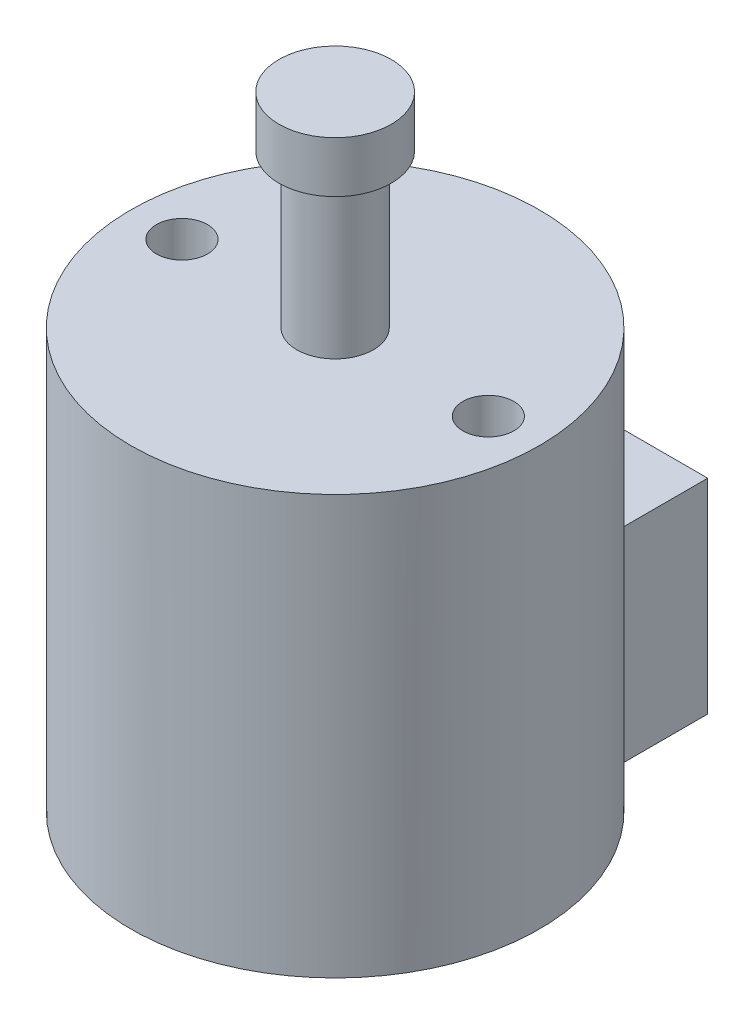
ISO-10303-21;
HEADER;
FILE_DESCRIPTION(('STEP AP214'),'2;1');
FILE_NAME('part.step','',(''),(''),'','','');
FILE_SCHEMA(('AUTOMOTIVE_DESIGN { 1 0 10303 214 1 1 1 1 }'));
ENDSEC;
DATA;
#1=APPLICATION_CONTEXT('core data for automotive mechanical design processes');
#2=APPLICATION_PROTOCOL_DEFINITION('international standard','automotive_design',2000,#1);
#3=PRODUCT_CONTEXT('',#1,'mechanical');
#4=PRODUCT('Part','Part','',(#3));
#5=PRODUCT_RELATED_PRODUCT_CATEGORY('part','',(#4));
#6=PRODUCT_DEFINITION_FORMATION('','',#4);
#7=PRODUCT_DEFINITION_CONTEXT('part definition',#1,'design');
#8=PRODUCT_DEFINITION('design','',#6,#7);
#9=PRODUCT_DEFINITION_SHAPE('','',#8);
#10=(LENGTH_UNIT() NAMED_UNIT(*) SI_UNIT(.MILLI.,.METRE.));
#11=(NAMED_UNIT(*) PLANE_ANGLE_UNIT() SI_UNIT($,.RADIAN.));
#12=(NAMED_UNIT(*) SI_UNIT($,.STERADIAN.) SOLID_ANGLE_UNIT());
#13=UNCERTAINTY_MEASURE_WITH_UNIT(LENGTH_MEASURE(1.E-05),#10,'distance_accuracy_value','');
#14=(GEOMETRIC_REPRESENTATION_CONTEXT(3) GLOBAL_UNCERTAINTY_ASSIGNED_CONTEXT((#13)) GLOBAL_UNIT_ASSIGNED_CONTEXT((#10,
#11,#12)) REPRESENTATION_CONTEXT('',''));
#15=CARTESIAN_POINT('',(0.,0.,0.));
#16=DIRECTION('',(0.,0.,1.));
#17=DIRECTION('',(1.,0.,0.));
#18=AXIS2_PLACEMENT_3D('',#15,#16,#17);
#19=CARTESIAN_POINT('',(0.,12.2,0.));
#20=DIRECTION('',(0.,-1.,0.));
#21=DIRECTION('',(0.,0.,-1.));
#22=AXIS2_PLACEMENT_3D('',#19,#20,#21);
#23=CYLINDRICAL_SURFACE('',#22,0.75);
#24=CARTESIAN_POINT('',(0.,8.2,0.));
#25=DIRECTION('',(0.,1.,0.));
#26=DIRECTION('',(0.,0.,1.));
#27=AXIS2_PLACEMENT_3D('',#24,#25,#26);
#28=CIRCLE('',#27,0.75);
#29=CARTESIAN_POINT('',(0.,8.2,0.75));
#30=VERTEX_POINT('',#29);
#31=EDGE_CURVE('E47',#30,#30,#28,.T.);
#32=ORIENTED_EDGE('',*,*,#31,.T.);
#33=EDGE_LOOP('',(#32));
#34=FACE_BOUND('',#33,.T.);
#35=CARTESIAN_POINT('',(0.,11.2,0.));
#36=DIRECTION('',(0.,1.,0.));
#37=DIRECTION('',(0.,0.,1.));
#38=AXIS2_PLACEMENT_3D('',#35,#36,#37);
#39=CIRCLE('',#38,0.75);
#40=CARTESIAN_POINT('',(0.,11.2,0.75));
#41=VERTEX_POINT('',#40);
#42=EDGE_CURVE('E11',#41,#41,#39,.T.);
#43=ORIENTED_EDGE('',*,*,#42,.F.);
#44=EDGE_LOOP('',(#43));
#45=FACE_BOUND('',#44,.T.);
#46=ADVANCED_FACE('F38',(#34,#45),#23,.T.);
#47=CARTESIAN_POINT('',(-2.,4.,-5.2963798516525));
#48=DIRECTION('',(0.,0.,1.));
#49=DIRECTION('',(1.,0.,0.));
#50=AXIS2_PLACEMENT_3D('',#47,#48,#49);
#51=PLANE('',#50);
#52=DIRECTION('',(1.,0.,0.));
#53=VECTOR('',#52,1.);
#54=CARTESIAN_POINT('',(0.840952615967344,2.16818239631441,-5.2963798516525));
#55=LINE('',#54,#53);
#56=CARTESIAN_POINT('',(0.175,2.16818239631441,-5.2963798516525));
#57=VERTEX_POINT('',#56);
#58=CARTESIAN_POINT('',(0.840952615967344,2.16818239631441,-5.2963798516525));
#59=VERTEX_POINT('',#58);
#60=EDGE_CURVE('E266',#57,#59,#55,.T.);
#61=ORIENTED_EDGE('',*,*,#60,.F.);
#62=DIRECTION('',(0.,1.,0.));
#63=VECTOR('',#62,1.);
#64=CARTESIAN_POINT('',(0.175,2.16818239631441,-5.2963798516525));
#65=LINE('',#64,#63);
#66=CARTESIAN_POINT('',(0.175,1.50222978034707,-5.2963798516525));
#67=VERTEX_POINT('',#66);
#68=EDGE_CURVE('E278',#67,#57,#65,.T.);
#69=ORIENTED_EDGE('',*,*,#68,.F.);
#70=DIRECTION('',(-1.,0.,0.));
#71=VECTOR('',#70,1.);
#72=CARTESIAN_POINT('',(0.840952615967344,1.50222978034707,-5.2963798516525));
#73=LINE('',#72,#71);
#74=CARTESIAN_POINT('',(0.840952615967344,1.50222978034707,-5.2963798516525));
#75=VERTEX_POINT('',#74);
#76=EDGE_CURVE('E274',#75,#67,#73,.T.);
#77=ORIENTED_EDGE('',*,*,#76,.F.);
#78=DIRECTION('',(0.,-1.,0.));
#79=VECTOR('',#78,1.);
#80=CARTESIAN_POINT('',(0.840952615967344,2.16818239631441,-5.2963798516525));
#81=LINE('',#80,#79);
#82=EDGE_CURVE('E270',#59,#75,#81,.T.);
#83=ORIENTED_EDGE('',*,*,#82,.F.);
#84=EDGE_LOOP('',(#61,#69,#77,#83));
#85=FACE_BOUND('',#84,.T.);
#86=DIRECTION('',(0.,1.,0.));
#87=VECTOR('',#86,1.);
#88=CARTESIAN_POINT('',(-1.85690523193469,2.16818239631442,-5.2963798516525));
#89=LINE('',#88,#87);
#90=CARTESIAN_POINT('',(-1.85690523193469,1.50222978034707,-5.2963798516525));
#91=VERTEX_POINT('',#90);
#92=CARTESIAN_POINT('',(-1.85690523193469,2.16818239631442,-5.2963798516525));
#93=VERTEX_POINT('',#92);
#94=EDGE_CURVE('E322',#91,#93,#89,.T.);
#95=ORIENTED_EDGE('',*,*,#94,.F.);
#96=DIRECTION('',(-1.,0.,0.));
#97=VECTOR('',#96,1.);
#98=CARTESIAN_POINT('',(-1.85690523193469,1.50222978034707,-5.2963798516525));
#99=LINE('',#98,#97);
#100=CARTESIAN_POINT('',(-1.19095261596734,1.50222978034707,-5.2963798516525));
#101=VERTEX_POINT('',#100);
#102=EDGE_CURVE('E334',#101,#91,#99,.T.);
#103=ORIENTED_EDGE('',*,*,#102,.F.);
#104=DIRECTION('',(0.,-1.,0.));
#105=VECTOR('',#104,1.);
#106=CARTESIAN_POINT('',(-1.19095261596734,2.16818239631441,-5.2963798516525));
#107=LINE('',#106,#105);
#108=CARTESIAN_POINT('',(-1.19095261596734,2.16818239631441,-5.2963798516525));
#109=VERTEX_POINT('',#108);
#110=EDGE_CURVE('E330',#109,#101,#107,.T.);
#111=ORIENTED_EDGE('',*,*,#110,.F.);
#112=DIRECTION('',(1.,0.,0.));
#113=VECTOR('',#112,1.);
#114=CARTESIAN_POINT('',(-1.85690523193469,2.16818239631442,-5.2963798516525));
#115=LINE('',#114,#113);
#116=EDGE_CURVE('E326',#93,#109,#115,.T.);
#117=ORIENTED_EDGE('',*,*,#116,.F.);
#118=EDGE_LOOP('',(#95,#103,#111,#117));
#119=FACE_BOUND('',#118,.T.);
#120=DIRECTION('',(-1.,0.,0.));
#121=VECTOR('',#120,1.);
#122=CARTESIAN_POINT('',(-2.,0.,-5.2963798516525));
#123=LINE('',#122,#121);
#124=CARTESIAN_POINT('',(2.,0.,-5.2963798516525));
#125=VERTEX_POINT('',#124);
#126=CARTESIAN_POINT('',(-2.,0.,-5.2963798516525));
#127=VERTEX_POINT('',#126);
#128=EDGE_CURVE('E356',#125,#127,#123,.T.);
#129=ORIENTED_EDGE('',*,*,#128,.T.);
#130=DIRECTION('',(0.,-1.,0.));
#131=VECTOR('',#130,1.);
#132=CARTESIAN_POINT('',(-2.,4.,-5.2963798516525));
#133=LINE('',#132,#131);
#134=CARTESIAN_POINT('',(-2.,4.,-5.2963798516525));
#135=VERTEX_POINT('',#134);
#136=EDGE_CURVE('E362',#135,#127,#133,.T.);
#137=ORIENTED_EDGE('',*,*,#136,.F.);
#138=DIRECTION('',(-1.,0.,0.));
#139=VECTOR('',#138,1.);
#140=CARTESIAN_POINT('',(-2.,4.,-5.2963798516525));
#141=LINE('',#140,#139);
#142=CARTESIAN_POINT('',(2.,4.,-5.2963798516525));
#143=VERTEX_POINT('',#142);
#144=EDGE_CURVE('E359',#143,#135,#141,.T.);
#145=ORIENTED_EDGE('',*,*,#144,.F.);
#146=DIRECTION('',(0.,-1.,0.));
#147=VECTOR('',#146,1.);
#148=CARTESIAN_POINT('',(2.,4.,-5.2963798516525));
#149=LINE('',#148,#147);
#150=EDGE_CURVE('E374',#143,#125,#149,.T.);
#151=ORIENTED_EDGE('',*,*,#150,.T.);
#152=EDGE_LOOP('',(#129,#137,#145,#151));
#153=FACE_BOUND('',#152,.T.);
#154=DIRECTION('',(0.,1.,0.));
#155=VECTOR('',#154,1.);
#156=CARTESIAN_POINT('',(-0.840952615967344,2.16818239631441,-5.2963798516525));
#157=LINE('',#156,#155);
#158=CARTESIAN_POINT('',(-0.840952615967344,1.50222978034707,-5.2963798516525));
#159=VERTEX_POINT('',#158);
#160=CARTESIAN_POINT('',(-0.840952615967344,2.16818239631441,-5.2963798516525));
#161=VERTEX_POINT('',#160);
#162=EDGE_CURVE('E294',#159,#161,#157,.T.);
#163=ORIENTED_EDGE('',*,*,#162,.F.);
#164=DIRECTION('',(-1.,0.,0.));
#165=VECTOR('',#164,1.);
#166=CARTESIAN_POINT('',(-0.840952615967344,1.50222978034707,-5.2963798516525));
#167=LINE('',#166,#165);
#168=CARTESIAN_POINT('',(-0.175,1.50222978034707,-5.2963798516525));
#169=VERTEX_POINT('',#168);
#170=EDGE_CURVE('E306',#169,#159,#167,.T.);
#171=ORIENTED_EDGE('',*,*,#170,.F.);
#172=DIRECTION('',(0.,-1.,0.));
#173=VECTOR('',#172,1.);
#174=CARTESIAN_POINT('',(-0.175,2.16818239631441,-5.2963798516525));
#175=LINE('',#174,#173);
#176=CARTESIAN_POINT('',(-0.175,2.16818239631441,-5.2963798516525));
#177=VERTEX_POINT('',#176);
#178=EDGE_CURVE('E302',#177,#169,#175,.T.);
#179=ORIENTED_EDGE('',*,*,#178,.F.);
#180=DIRECTION('',(1.,0.,0.));
#181=VECTOR('',#180,1.);
#182=CARTESIAN_POINT('',(-0.840952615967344,2.16818239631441,-5.2963798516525));
#183=LINE('',#182,#181);
#184=EDGE_CURVE('E298',#161,#177,#183,.T.);
#185=ORIENTED_EDGE('',*,*,#184,.F.);
#186=EDGE_LOOP('',(#163,#171,#179,#185));
#187=FACE_BOUND('',#186,.T.);
#188=DIRECTION('',(1.,0.,0.));
#189=VECTOR('',#188,1.);
#190=CARTESIAN_POINT('',(1.85690523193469,2.16818239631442,-5.2963798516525));
#191=LINE('',#190,#189);
#192=CARTESIAN_POINT('',(1.19095261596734,2.16818239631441,-5.2963798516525));
#193=VERTEX_POINT('',#192);
#194=CARTESIAN_POINT('',(1.85690523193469,2.16818239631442,-5.2963798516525));
#195=VERTEX_POINT('',#194);
#196=EDGE_CURVE('E228',#193,#195,#191,.T.);
#197=ORIENTED_EDGE('',*,*,#196,.F.);
#198=DIRECTION('',(0.,1.,0.));
#199=VECTOR('',#198,1.);
#200=CARTESIAN_POINT('',(1.19095261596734,2.16818239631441,-5.2963798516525));
#201=LINE('',#200,#199);
#202=CARTESIAN_POINT('',(1.19095261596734,1.50222978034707,-5.2963798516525));
#203=VERTEX_POINT('',#202);
#204=EDGE_CURVE('E237',#203,#193,#201,.T.);
#205=ORIENTED_EDGE('',*,*,#204,.F.);
#206=DIRECTION('',(-1.,0.,0.));
#207=VECTOR('',#206,1.);
#208=CARTESIAN_POINT('',(1.85690523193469,1.50222978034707,-5.2963798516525));
#209=LINE('',#208,#207);
#210=CARTESIAN_POINT('',(1.85690523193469,1.50222978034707,-5.2963798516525));
#211=VERTEX_POINT('',#210);
#212=EDGE_CURVE('E252',#211,#203,#209,.T.);
#213=ORIENTED_EDGE('',*,*,#212,.F.);
#214=DIRECTION('',(0.,-1.,0.));
#215=VECTOR('',#214,1.);
#216=CARTESIAN_POINT('',(1.85690523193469,2.16818239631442,-5.2963798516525));
#217=LINE('',#216,#215);
#218=EDGE_CURVE('E246',#195,#211,#217,.T.);
#219=ORIENTED_EDGE('',*,*,#218,.F.);
#220=EDGE_LOOP('',(#197,#205,#213,#219));
#221=FACE_BOUND('',#220,.T.);
#222=ADVANCED_FACE('F242',(#85,#119,#153,#187,#221),#51,.F.);
#223=CARTESIAN_POINT('',(0.,8.2,0.));
#224=DIRECTION('',(0.,-1.,0.));
#225=DIRECTION('',(0.,0.,-1.));
#226=AXIS2_PLACEMENT_3D('',#223,#224,#225);
#227=CYLINDRICAL_SURFACE('',#226,4.);
#228=CARTESIAN_POINT('',(0.,8.2,0.));
#229=DIRECTION('',(0.,1.,0.));
#230=DIRECTION('',(0.,0.,1.));
#231=AXIS2_PLACEMENT_3D('',#228,#229,#230);
#232=CIRCLE('',#231,4.);
#233=CARTESIAN_POINT('',(0.,8.2,4.));
#234=VERTEX_POINT('',#233);
#235=EDGE_CURVE('E387',#234,#234,#232,.T.);
#236=ORIENTED_EDGE('',*,*,#235,.F.);
#237=EDGE_LOOP('',(#236));
#238=FACE_BOUND('',#237,.T.);
#239=DIRECTION('',(0.,-1.,0.));
#240=VECTOR('',#239,1.);
#241=CARTESIAN_POINT('',(-2.,8.2,-3.46410161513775));
#242=LINE('',#241,#240);
#243=CARTESIAN_POINT('',(-2.,0.,-3.46410161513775));
#244=VERTEX_POINT('',#243);
#245=CARTESIAN_POINT('',(-2.,4.,-3.46410161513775));
#246=VERTEX_POINT('',#245);
#247=EDGE_CURVE('E382',#244,#246,#242,.F.);
#248=ORIENTED_EDGE('',*,*,#247,.F.);
#249=CARTESIAN_POINT('',(0.,0.,0.));
#250=DIRECTION('',(0.,1.,0.));
#251=DIRECTION('',(0.,0.,1.));
#252=AXIS2_PLACEMENT_3D('',#249,#250,#251);
#253=CIRCLE('',#252,4.);
#254=CARTESIAN_POINT('',(2.,0.,-3.46410161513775));
#255=VERTEX_POINT('',#254);
#256=EDGE_CURVE('E386',#244,#255,#253,.T.);
#257=ORIENTED_EDGE('',*,*,#256,.T.);
#258=DIRECTION('',(0.,-1.,0.));
#259=VECTOR('',#258,1.);
#260=CARTESIAN_POINT('',(2.,8.2,-3.46410161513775));
#261=LINE('',#260,#259);
#262=CARTESIAN_POINT('',(2.,4.,-3.46410161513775));
#263=VERTEX_POINT('',#262);
#264=EDGE_CURVE('E378',#263,#255,#261,.T.);
#265=ORIENTED_EDGE('',*,*,#264,.F.);
#266=CARTESIAN_POINT('',(0.,4.,0.));
#267=DIRECTION('',(0.,1.,0.));
#268=DIRECTION('',(0.,0.,1.));
#269=AXIS2_PLACEMENT_3D('',#266,#267,#268);
#270=CIRCLE('',#269,4.);
#271=EDGE_CURVE('E391',#263,#246,#270,.T.);
#272=ORIENTED_EDGE('',*,*,#271,.T.);
#273=EDGE_LOOP('',(#248,#257,#265,#272));
#274=FACE_BOUND('',#273,.T.);
#275=ADVANCED_FACE('F609',(#238,#274),#227,.T.);
#276=CARTESIAN_POINT('',(0.,8.2,0.));
#277=DIRECTION('',(0.,1.,0.));
#278=DIRECTION('',(0.,0.,1.));
#279=AXIS2_PLACEMENT_3D('',#276,#277,#278);
#280=PLANE('',#279);
#281=CARTESIAN_POINT('',(3.,8.2,0.));
#282=DIRECTION('',(0.,1.,0.));
#283=DIRECTION('',(0.,0.,1.));
#284=AXIS2_PLACEMENT_3D('',#281,#282,#283);
#285=CIRCLE('',#284,0.5);
#286=CARTESIAN_POINT('',(3.,8.2,0.5));
#287=VERTEX_POINT('',#286);
#288=EDGE_CURVE('E588',#287,#287,#285,.T.);
#289=ORIENTED_EDGE('',*,*,#288,.F.);
#290=EDGE_LOOP('',(#289));
#291=FACE_BOUND('',#290,.T.);
#292=CARTESIAN_POINT('',(-3.,8.2,0.));
#293=DIRECTION('',(0.,1.,0.));
#294=DIRECTION('',(0.,0.,1.));
#295=AXIS2_PLACEMENT_3D('',#292,#293,#294);
#296=CIRCLE('',#295,0.5);
#297=CARTESIAN_POINT('',(-3.,8.2,0.5));
#298=VERTEX_POINT('',#297);
#299=EDGE_CURVE('E584',#298,#298,#296,.T.);
#300=ORIENTED_EDGE('',*,*,#299,.F.);
#301=EDGE_LOOP('',(#300));
#302=FACE_BOUND('',#301,.T.);
#303=ORIENTED_EDGE('',*,*,#31,.F.);
#304=EDGE_LOOP('',(#303));
#305=FACE_BOUND('',#304,.T.);
#306=ORIENTED_EDGE('',*,*,#235,.T.);
#307=EDGE_LOOP('',(#306));
#308=FACE_BOUND('',#307,.T.);
#309=ADVANCED_FACE('F605',(#291,#302,#305,#308),#280,.T.);
#310=CARTESIAN_POINT('',(0.,0.,0.));
#311=DIRECTION('',(0.,1.,0.));
#312=DIRECTION('',(0.,0.,1.));
#313=AXIS2_PLACEMENT_3D('',#310,#311,#312);
#314=PLANE('',#313);
#315=ORIENTED_EDGE('',*,*,#256,.F.);
#316=DIRECTION('',(0.,0.,1.));
#317=VECTOR('',#316,1.);
#318=CARTESIAN_POINT('',(-2.,0.,-5.2963798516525));
#319=LINE('',#318,#317);
#320=EDGE_CURVE('E350',#127,#244,#319,.T.);
#321=ORIENTED_EDGE('',*,*,#320,.F.);
#322=ORIENTED_EDGE('',*,*,#128,.F.);
#323=DIRECTION('',(0.,0.,-1.));
#324=VECTOR('',#323,1.);
#325=CARTESIAN_POINT('',(2.,0.,-5.2963798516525));
#326=LINE('',#325,#324);
#327=EDGE_CURVE('E366',#255,#125,#326,.T.);
#328=ORIENTED_EDGE('',*,*,#327,.F.);
#329=EDGE_LOOP('',(#315,#321,#322,#328));
#330=FACE_BOUND('',#329,.T.);
#331=ADVANCED_FACE('F608',(#330),#314,.F.);
#332=CARTESIAN_POINT('',(-2.,4.,-5.2963798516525));
#333=DIRECTION('',(1.,0.,0.));
#334=DIRECTION('',(0.,0.,-1.));
#335=AXIS2_PLACEMENT_3D('',#332,#333,#334);
#336=PLANE('',#335);
#337=ORIENTED_EDGE('',*,*,#320,.T.);
#338=ORIENTED_EDGE('',*,*,#247,.T.);
#339=DIRECTION('',(0.,0.,1.));
#340=VECTOR('',#339,1.);
#341=CARTESIAN_POINT('',(-2.,4.,-5.2963798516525));
#342=LINE('',#341,#340);
#343=EDGE_CURVE('E351',#135,#246,#342,.T.);
#344=ORIENTED_EDGE('',*,*,#343,.F.);
#345=ORIENTED_EDGE('',*,*,#136,.T.);
#346=EDGE_LOOP('',(#337,#338,#344,#345));
#347=FACE_BOUND('',#346,.T.);
#348=ADVANCED_FACE('F625',(#347),#336,.F.);
#349=CARTESIAN_POINT('',(2.,4.,-5.2963798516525));
#350=DIRECTION('',(-1.,0.,0.));
#351=DIRECTION('',(0.,0.,1.));
#352=AXIS2_PLACEMENT_3D('',#349,#350,#351);
#353=PLANE('',#352);
#354=DIRECTION('',(0.,0.,-1.));
#355=VECTOR('',#354,1.);
#356=CARTESIAN_POINT('',(2.,4.,-5.2963798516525));
#357=LINE('',#356,#355);
#358=EDGE_CURVE('E355',#263,#143,#357,.T.);
#359=ORIENTED_EDGE('',*,*,#358,.F.);
#360=ORIENTED_EDGE('',*,*,#264,.T.);
#361=ORIENTED_EDGE('',*,*,#327,.T.);
#362=ORIENTED_EDGE('',*,*,#150,.F.);
#363=EDGE_LOOP('',(#359,#360,#361,#362));
#364=FACE_BOUND('',#363,.T.);
#365=ADVANCED_FACE('F633',(#364),#353,.F.);
#366=CARTESIAN_POINT('',(0.,4.,0.));
#367=DIRECTION('',(0.,1.,0.));
#368=DIRECTION('',(0.,0.,1.));
#369=AXIS2_PLACEMENT_3D('',#366,#367,#368);
#370=PLANE('',#369);
#371=ORIENTED_EDGE('',*,*,#271,.F.);
#372=ORIENTED_EDGE('',*,*,#358,.T.);
#373=ORIENTED_EDGE('',*,*,#144,.T.);
#374=ORIENTED_EDGE('',*,*,#343,.T.);
#375=EDGE_LOOP('',(#371,#372,#373,#374));
#376=FACE_BOUND('',#375,.T.);
#377=ADVANCED_FACE('F638',(#376),#370,.T.);
#378=CARTESIAN_POINT('',(-1.85690523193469,2.16818239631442,-5.5503798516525));
#379=DIRECTION('',(1.,0.,0.));
#380=DIRECTION('',(0.,0.,-1.));
#381=AXIS2_PLACEMENT_3D('',#378,#379,#380);
#382=PLANE('',#381);
#383=DIRECTION('',(0.,0.,1.));
#384=VECTOR('',#383,1.);
#385=CARTESIAN_POINT('',(-1.85690523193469,2.16818239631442,-5.5503798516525));
#386=LINE('',#385,#384);
#387=CARTESIAN_POINT('',(-1.85690523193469,2.16818239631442,-5.3503798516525));
#388=VERTEX_POINT('',#387);
#389=EDGE_CURVE('E347',#388,#93,#386,.T.);
#390=ORIENTED_EDGE('',*,*,#389,.F.);
#391=DIRECTION('',(0.,1.,0.));
#392=VECTOR('',#391,1.);
#393=CARTESIAN_POINT('',(-1.85690523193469,2.16818239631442,-5.3503798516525));
#394=LINE('',#393,#392);
#395=CARTESIAN_POINT('',(-1.85690523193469,1.50222978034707,-5.3503798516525));
#396=VERTEX_POINT('',#395);
#397=EDGE_CURVE('E419',#388,#396,#394,.F.);
#398=ORIENTED_EDGE('',*,*,#397,.T.);
#399=DIRECTION('',(0.,0.,1.));
#400=VECTOR('',#399,1.);
#401=CARTESIAN_POINT('',(-1.85690523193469,1.50222978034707,-5.5503798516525));
#402=LINE('',#401,#400);
#403=EDGE_CURVE('E338',#396,#91,#402,.T.);
#404=ORIENTED_EDGE('',*,*,#403,.T.);
#405=ORIENTED_EDGE('',*,*,#94,.T.);
#406=EDGE_LOOP('',(#390,#398,#404,#405));
#407=FACE_BOUND('',#406,.T.);
#408=ADVANCED_FACE('F640',(#407),#382,.F.);
#409=CARTESIAN_POINT('',(-1.85690523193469,2.16818239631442,-5.5503798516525));
#410=DIRECTION('',(0.,-1.,0.));
#411=DIRECTION('',(1.,0.,0.));
#412=AXIS2_PLACEMENT_3D('',#409,#410,#411);
#413=PLANE('',#412);
#414=DIRECTION('',(0.,0.,1.));
#415=VECTOR('',#414,1.);
#416=CARTESIAN_POINT('',(-1.19095261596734,2.16818239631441,-5.5503798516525));
#417=LINE('',#416,#415);
#418=CARTESIAN_POINT('',(-1.19095261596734,2.16818239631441,-5.3503798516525));
#419=VERTEX_POINT('',#418);
#420=EDGE_CURVE('E344',#419,#109,#417,.T.);
#421=ORIENTED_EDGE('',*,*,#420,.F.);
#422=DIRECTION('',(1.,0.,0.));
#423=VECTOR('',#422,1.);
#424=CARTESIAN_POINT('',(-1.85690523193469,2.16818239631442,-5.3503798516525));
#425=LINE('',#424,#423);
#426=EDGE_CURVE('E416',#419,#388,#425,.F.);
#427=ORIENTED_EDGE('',*,*,#426,.T.);
#428=ORIENTED_EDGE('',*,*,#389,.T.);
#429=ORIENTED_EDGE('',*,*,#116,.T.);
#430=EDGE_LOOP('',(#421,#427,#428,#429));
#431=FACE_BOUND('',#430,.T.);
#432=ADVANCED_FACE('F646',(#431),#413,.F.);
#433=CARTESIAN_POINT('',(-1.19095261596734,2.16818239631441,-5.5503798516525));
#434=DIRECTION('',(-1.,0.,0.));
#435=DIRECTION('',(0.,0.,1.));
#436=AXIS2_PLACEMENT_3D('',#433,#434,#435);
#437=PLANE('',#436);
#438=DIRECTION('',(0.,0.,1.));
#439=VECTOR('',#438,1.);
#440=CARTESIAN_POINT('',(-1.19095261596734,1.50222978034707,-5.5503798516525));
#441=LINE('',#440,#439);
#442=CARTESIAN_POINT('',(-1.19095261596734,1.50222978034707,-5.3503798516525));
#443=VERTEX_POINT('',#442);
#444=EDGE_CURVE('E341',#443,#101,#441,.T.);
#445=ORIENTED_EDGE('',*,*,#444,.F.);
#446=DIRECTION('',(0.,-1.,0.));
#447=VECTOR('',#446,1.);
#448=CARTESIAN_POINT('',(-1.19095261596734,2.16818239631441,-5.3503798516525));
#449=LINE('',#448,#447);
#450=EDGE_CURVE('E413',#443,#419,#449,.F.);
#451=ORIENTED_EDGE('',*,*,#450,.T.);
#452=ORIENTED_EDGE('',*,*,#420,.T.);
#453=ORIENTED_EDGE('',*,*,#110,.T.);
#454=EDGE_LOOP('',(#445,#451,#452,#453));
#455=FACE_BOUND('',#454,.T.);
#456=ADVANCED_FACE('F723',(#455),#437,.F.);
#457=CARTESIAN_POINT('',(-1.85690523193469,1.50222978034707,-5.5503798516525));
#458=DIRECTION('',(0.,1.,0.));
#459=DIRECTION('',(0.,0.,1.));
#460=AXIS2_PLACEMENT_3D('',#457,#458,#459);
#461=PLANE('',#460);
#462=ORIENTED_EDGE('',*,*,#403,.F.);
#463=DIRECTION('',(-1.,0.,0.));
#464=VECTOR('',#463,1.);
#465=CARTESIAN_POINT('',(-1.85690523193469,1.50222978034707,-5.3503798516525));
#466=LINE('',#465,#464);
#467=EDGE_CURVE('E409',#396,#443,#466,.F.);
#468=ORIENTED_EDGE('',*,*,#467,.T.);
#469=ORIENTED_EDGE('',*,*,#444,.T.);
#470=ORIENTED_EDGE('',*,*,#102,.T.);
#471=EDGE_LOOP('',(#462,#468,#469,#470));
#472=FACE_BOUND('',#471,.T.);
#473=ADVANCED_FACE('F719',(#472),#461,.F.);
#474=CARTESIAN_POINT('',(0.,0.,-5.5503798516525));
#475=DIRECTION('',(0.,0.,1.));
#476=DIRECTION('',(1.,0.,0.));
#477=AXIS2_PLACEMENT_3D('',#474,#475,#476);
#478=PLANE('',#477);
#479=DIRECTION('',(0.,-1.,0.));
#480=VECTOR('',#479,1.);
#481=CARTESIAN_POINT('',(-1.39095261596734,0.,-5.5503798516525));
#482=LINE('',#481,#480);
#483=CARTESIAN_POINT('',(-1.39095261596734,1.96818239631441,-5.5503798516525));
#484=VERTEX_POINT('',#483);
#485=CARTESIAN_POINT('',(-1.39095261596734,1.70222978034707,-5.5503798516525));
#486=VERTEX_POINT('',#485);
#487=EDGE_CURVE('E402',#484,#486,#482,.T.);
#488=ORIENTED_EDGE('',*,*,#487,.T.);
#489=DIRECTION('',(-1.,0.,0.));
#490=VECTOR('',#489,1.);
#491=CARTESIAN_POINT('',(0.,1.70222978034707,-5.5503798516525));
#492=LINE('',#491,#490);
#493=CARTESIAN_POINT('',(-1.65690523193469,1.70222978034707,-5.5503798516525));
#494=VERTEX_POINT('',#493);
#495=EDGE_CURVE('E405',#486,#494,#492,.T.);
#496=ORIENTED_EDGE('',*,*,#495,.T.);
#497=DIRECTION('',(0.,1.,0.));
#498=VECTOR('',#497,1.);
#499=CARTESIAN_POINT('',(-1.65690523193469,0.,-5.5503798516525));
#500=LINE('',#499,#498);
#501=CARTESIAN_POINT('',(-1.65690523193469,1.96818239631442,-5.5503798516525));
#502=VERTEX_POINT('',#501);
#503=EDGE_CURVE('E396',#494,#502,#500,.T.);
#504=ORIENTED_EDGE('',*,*,#503,.T.);
#505=DIRECTION('',(1.,0.,0.));
#506=VECTOR('',#505,1.);
#507=CARTESIAN_POINT('',(0.,1.96818239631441,-5.5503798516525));
#508=LINE('',#507,#506);
#509=EDGE_CURVE('E399',#502,#484,#508,.T.);
#510=ORIENTED_EDGE('',*,*,#509,.T.);
#511=EDGE_LOOP('',(#488,#496,#504,#510));
#512=FACE_BOUND('',#511,.T.);
#513=ADVANCED_FACE('F715',(#512),#478,.F.);
#514=CARTESIAN_POINT('',(-0.840952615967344,2.16818239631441,-5.5503798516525));
#515=DIRECTION('',(1.,0.,0.));
#516=DIRECTION('',(0.,0.,-1.));
#517=AXIS2_PLACEMENT_3D('',#514,#515,#516);
#518=PLANE('',#517);
#519=DIRECTION('',(0.,0.,1.));
#520=VECTOR('',#519,1.);
#521=CARTESIAN_POINT('',(-0.840952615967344,2.16818239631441,-5.5503798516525));
#522=LINE('',#521,#520);
#523=CARTESIAN_POINT('',(-0.840952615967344,2.16818239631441,-5.3503798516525));
#524=VERTEX_POINT('',#523);
#525=EDGE_CURVE('E319',#524,#161,#522,.T.);
#526=ORIENTED_EDGE('',*,*,#525,.F.);
#527=DIRECTION('',(0.,1.,0.));
#528=VECTOR('',#527,1.);
#529=CARTESIAN_POINT('',(-0.840952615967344,2.16818239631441,-5.3503798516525));
#530=LINE('',#529,#528);
#531=CARTESIAN_POINT('',(-0.840952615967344,1.50222978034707,-5.3503798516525));
#532=VERTEX_POINT('',#531);
#533=EDGE_CURVE('E445',#524,#532,#530,.F.);
#534=ORIENTED_EDGE('',*,*,#533,.T.);
#535=DIRECTION('',(0.,0.,1.));
#536=VECTOR('',#535,1.);
#537=CARTESIAN_POINT('',(-0.840952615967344,1.50222978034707,-5.5503798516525));
#538=LINE('',#537,#536);
#539=EDGE_CURVE('E310',#532,#159,#538,.T.);
#540=ORIENTED_EDGE('',*,*,#539,.T.);
#541=ORIENTED_EDGE('',*,*,#162,.T.);
#542=EDGE_LOOP('',(#526,#534,#540,#541));
#543=FACE_BOUND('',#542,.T.);
#544=ADVANCED_FACE('F711',(#543),#518,.F.);
#545=CARTESIAN_POINT('',(-0.840952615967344,2.16818239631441,-5.5503798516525));
#546=DIRECTION('',(0.,-1.,0.));
#547=DIRECTION('',(0.,0.,-1.));
#548=AXIS2_PLACEMENT_3D('',#545,#546,#547);
#549=PLANE('',#548);
#550=DIRECTION('',(0.,0.,1.));
#551=VECTOR('',#550,1.);
#552=CARTESIAN_POINT('',(-0.175,2.16818239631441,-5.5503798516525));
#553=LINE('',#552,#551);
#554=CARTESIAN_POINT('',(-0.175,2.16818239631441,-5.3503798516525));
#555=VERTEX_POINT('',#554);
#556=EDGE_CURVE('E316',#555,#177,#553,.T.);
#557=ORIENTED_EDGE('',*,*,#556,.F.);
#558=DIRECTION('',(1.,0.,0.));
#559=VECTOR('',#558,1.);
#560=CARTESIAN_POINT('',(-0.840952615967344,2.16818239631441,-5.3503798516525));
#561=LINE('',#560,#559);
#562=EDGE_CURVE('E442',#555,#524,#561,.F.);
#563=ORIENTED_EDGE('',*,*,#562,.T.);
#564=ORIENTED_EDGE('',*,*,#525,.T.);
#565=ORIENTED_EDGE('',*,*,#184,.T.);
#566=EDGE_LOOP('',(#557,#563,#564,#565));
#567=FACE_BOUND('',#566,.T.);
#568=ADVANCED_FACE('F707',(#567),#549,.F.);
#569=CARTESIAN_POINT('',(-0.175,2.16818239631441,-5.5503798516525));
#570=DIRECTION('',(-1.,0.,0.));
#571=DIRECTION('',(0.,-1.,0.));
#572=AXIS2_PLACEMENT_3D('',#569,#570,#571);
#573=PLANE('',#572);
#574=DIRECTION('',(0.,0.,1.));
#575=VECTOR('',#574,1.);
#576=CARTESIAN_POINT('',(-0.175,1.50222978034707,-5.5503798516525));
#577=LINE('',#576,#575);
#578=CARTESIAN_POINT('',(-0.175,1.50222978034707,-5.3503798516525));
#579=VERTEX_POINT('',#578);
#580=EDGE_CURVE('E313',#579,#169,#577,.T.);
#581=ORIENTED_EDGE('',*,*,#580,.F.);
#582=DIRECTION('',(0.,-1.,0.));
#583=VECTOR('',#582,1.);
#584=CARTESIAN_POINT('',(-0.175,2.16818239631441,-5.3503798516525));
#585=LINE('',#584,#583);
#586=EDGE_CURVE('E439',#579,#555,#585,.F.);
#587=ORIENTED_EDGE('',*,*,#586,.T.);
#588=ORIENTED_EDGE('',*,*,#556,.T.);
#589=ORIENTED_EDGE('',*,*,#178,.T.);
#590=EDGE_LOOP('',(#581,#587,#588,#589));
#591=FACE_BOUND('',#590,.T.);
#592=ADVANCED_FACE('F703',(#591),#573,.F.);
#593=CARTESIAN_POINT('',(-0.840952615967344,1.50222978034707,-5.5503798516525));
#594=DIRECTION('',(0.,1.,0.));
#595=DIRECTION('',(0.,0.,1.));
#596=AXIS2_PLACEMENT_3D('',#593,#594,#595);
#597=PLANE('',#596);
#598=ORIENTED_EDGE('',*,*,#539,.F.);
#599=DIRECTION('',(-1.,0.,0.));
#600=VECTOR('',#599,1.);
#601=CARTESIAN_POINT('',(-0.840952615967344,1.50222978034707,-5.3503798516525));
#602=LINE('',#601,#600);
#603=EDGE_CURVE('E435',#532,#579,#602,.F.);
#604=ORIENTED_EDGE('',*,*,#603,.T.);
#605=ORIENTED_EDGE('',*,*,#580,.T.);
#606=ORIENTED_EDGE('',*,*,#170,.T.);
#607=EDGE_LOOP('',(#598,#604,#605,#606));
#608=FACE_BOUND('',#607,.T.);
#609=ADVANCED_FACE('F699',(#608),#597,.F.);
#610=CARTESIAN_POINT('',(0.,0.,-5.5503798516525));
#611=DIRECTION('',(0.,0.,1.));
#612=DIRECTION('',(1.,0.,0.));
#613=AXIS2_PLACEMENT_3D('',#610,#611,#612);
#614=PLANE('',#613);
#615=DIRECTION('',(0.,-1.,0.));
#616=VECTOR('',#615,1.);
#617=CARTESIAN_POINT('',(-0.375,0.,-5.5503798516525));
#618=LINE('',#617,#616);
#619=CARTESIAN_POINT('',(-0.375,1.96818239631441,-5.5503798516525));
#620=VERTEX_POINT('',#619);
#621=CARTESIAN_POINT('',(-0.375,1.70222978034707,-5.5503798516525));
#622=VERTEX_POINT('',#621);
#623=EDGE_CURVE('E428',#620,#622,#618,.T.);
#624=ORIENTED_EDGE('',*,*,#623,.T.);
#625=DIRECTION('',(-1.,0.,0.));
#626=VECTOR('',#625,1.);
#627=CARTESIAN_POINT('',(0.,1.70222978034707,-5.5503798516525));
#628=LINE('',#627,#626);
#629=CARTESIAN_POINT('',(-0.640952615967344,1.70222978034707,-5.5503798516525));
#630=VERTEX_POINT('',#629);
#631=EDGE_CURVE('E431',#622,#630,#628,.T.);
#632=ORIENTED_EDGE('',*,*,#631,.T.);
#633=DIRECTION('',(0.,1.,0.));
#634=VECTOR('',#633,1.);
#635=CARTESIAN_POINT('',(-0.640952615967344,0.,-5.5503798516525));
#636=LINE('',#635,#634);
#637=CARTESIAN_POINT('',(-0.640952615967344,1.96818239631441,-5.5503798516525));
#638=VERTEX_POINT('',#637);
#639=EDGE_CURVE('E422',#630,#638,#636,.T.);
#640=ORIENTED_EDGE('',*,*,#639,.T.);
#641=DIRECTION('',(1.,0.,0.));
#642=VECTOR('',#641,1.);
#643=CARTESIAN_POINT('',(0.,1.96818239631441,-5.5503798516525));
#644=LINE('',#643,#642);
#645=EDGE_CURVE('E425',#638,#620,#644,.T.);
#646=ORIENTED_EDGE('',*,*,#645,.T.);
#647=EDGE_LOOP('',(#624,#632,#640,#646));
#648=FACE_BOUND('',#647,.T.);
#649=ADVANCED_FACE('F695',(#648),#614,.F.);
#650=CARTESIAN_POINT('',(0.840952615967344,2.16818239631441,-5.5503798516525));
#651=DIRECTION('',(0.,-1.,0.));
#652=DIRECTION('',(0.,0.,-1.));
#653=AXIS2_PLACEMENT_3D('',#650,#651,#652);
#654=PLANE('',#653);
#655=DIRECTION('',(0.,0.,1.));
#656=VECTOR('',#655,1.);
#657=CARTESIAN_POINT('',(0.840952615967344,2.16818239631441,-5.5503798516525));
#658=LINE('',#657,#656);
#659=CARTESIAN_POINT('',(0.840952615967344,2.16818239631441,-5.3503798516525));
#660=VERTEX_POINT('',#659);
#661=EDGE_CURVE('E291',#660,#59,#658,.T.);
#662=ORIENTED_EDGE('',*,*,#661,.F.);
#663=DIRECTION('',(1.,0.,0.));
#664=VECTOR('',#663,1.);
#665=CARTESIAN_POINT('',(0.840952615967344,2.16818239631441,-5.3503798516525));
#666=LINE('',#665,#664);
#667=CARTESIAN_POINT('',(0.175,2.16818239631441,-5.3503798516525));
#668=VERTEX_POINT('',#667);
#669=EDGE_CURVE('E471',#660,#668,#666,.F.);
#670=ORIENTED_EDGE('',*,*,#669,.T.);
#671=DIRECTION('',(0.,0.,1.));
#672=VECTOR('',#671,1.);
#673=CARTESIAN_POINT('',(0.175,2.16818239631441,-5.5503798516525));
#674=LINE('',#673,#672);
#675=EDGE_CURVE('E282',#668,#57,#674,.T.);
#676=ORIENTED_EDGE('',*,*,#675,.T.);
#677=ORIENTED_EDGE('',*,*,#60,.T.);
#678=EDGE_LOOP('',(#662,#670,#676,#677));
#679=FACE_BOUND('',#678,.T.);
#680=ADVANCED_FACE('F691',(#679),#654,.F.);
#681=CARTESIAN_POINT('',(0.840952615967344,2.16818239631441,-5.5503798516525));
#682=DIRECTION('',(-1.,0.,0.));
#683=DIRECTION('',(0.,0.,1.));
#684=AXIS2_PLACEMENT_3D('',#681,#682,#683);
#685=PLANE('',#684);
#686=DIRECTION('',(0.,0.,1.));
#687=VECTOR('',#686,1.);
#688=CARTESIAN_POINT('',(0.840952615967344,1.50222978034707,-5.5503798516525));
#689=LINE('',#688,#687);
#690=CARTESIAN_POINT('',(0.840952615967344,1.50222978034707,-5.3503798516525));
#691=VERTEX_POINT('',#690);
#692=EDGE_CURVE('E288',#691,#75,#689,.T.);
#693=ORIENTED_EDGE('',*,*,#692,.F.);
#694=DIRECTION('',(0.,-1.,0.));
#695=VECTOR('',#694,1.);
#696=CARTESIAN_POINT('',(0.840952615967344,2.16818239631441,-5.3503798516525));
#697=LINE('',#696,#695);
#698=EDGE_CURVE('E468',#691,#660,#697,.F.);
#699=ORIENTED_EDGE('',*,*,#698,.T.);
#700=ORIENTED_EDGE('',*,*,#661,.T.);
#701=ORIENTED_EDGE('',*,*,#82,.T.);
#702=EDGE_LOOP('',(#693,#699,#700,#701));
#703=FACE_BOUND('',#702,.T.);
#704=ADVANCED_FACE('F687',(#703),#685,.F.);
#705=CARTESIAN_POINT('',(0.840952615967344,1.50222978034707,-5.5503798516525));
#706=DIRECTION('',(0.,1.,0.));
#707=DIRECTION('',(0.,0.,1.));
#708=AXIS2_PLACEMENT_3D('',#705,#706,#707);
#709=PLANE('',#708);
#710=DIRECTION('',(0.,0.,1.));
#711=VECTOR('',#710,1.);
#712=CARTESIAN_POINT('',(0.175,1.50222978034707,-5.5503798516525));
#713=LINE('',#712,#711);
#714=CARTESIAN_POINT('',(0.175,1.50222978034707,-5.3503798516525));
#715=VERTEX_POINT('',#714);
#716=EDGE_CURVE('E285',#715,#67,#713,.T.);
#717=ORIENTED_EDGE('',*,*,#716,.F.);
#718=DIRECTION('',(-1.,0.,0.));
#719=VECTOR('',#718,1.);
#720=CARTESIAN_POINT('',(0.840952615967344,1.50222978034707,-5.3503798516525));
#721=LINE('',#720,#719);
#722=EDGE_CURVE('E465',#715,#691,#721,.F.);
#723=ORIENTED_EDGE('',*,*,#722,.T.);
#724=ORIENTED_EDGE('',*,*,#692,.T.);
#725=ORIENTED_EDGE('',*,*,#76,.T.);
#726=EDGE_LOOP('',(#717,#723,#724,#725));
#727=FACE_BOUND('',#726,.T.);
#728=ADVANCED_FACE('F683',(#727),#709,.F.);
#729=CARTESIAN_POINT('',(0.175,2.16818239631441,-5.5503798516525));
#730=DIRECTION('',(1.,0.,0.));
#731=DIRECTION('',(0.,1.,0.));
#732=AXIS2_PLACEMENT_3D('',#729,#730,#731);
#733=PLANE('',#732);
#734=ORIENTED_EDGE('',*,*,#675,.F.);
#735=DIRECTION('',(0.,1.,0.));
#736=VECTOR('',#735,1.);
#737=CARTESIAN_POINT('',(0.175,2.16818239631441,-5.3503798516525));
#738=LINE('',#737,#736);
#739=EDGE_CURVE('E461',#668,#715,#738,.F.);
#740=ORIENTED_EDGE('',*,*,#739,.T.);
#741=ORIENTED_EDGE('',*,*,#716,.T.);
#742=ORIENTED_EDGE('',*,*,#68,.T.);
#743=EDGE_LOOP('',(#734,#740,#741,#742));
#744=FACE_BOUND('',#743,.T.);
#745=ADVANCED_FACE('F679',(#744),#733,.F.);
#746=CARTESIAN_POINT('',(0.,0.,-5.5503798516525));
#747=DIRECTION('',(0.,0.,1.));
#748=DIRECTION('',(1.,0.,0.));
#749=AXIS2_PLACEMENT_3D('',#746,#747,#748);
#750=PLANE('',#749);
#751=DIRECTION('',(-1.,0.,0.));
#752=VECTOR('',#751,1.);
#753=CARTESIAN_POINT('',(0.,1.70222978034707,-5.5503798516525));
#754=LINE('',#753,#752);
#755=CARTESIAN_POINT('',(0.640952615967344,1.70222978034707,-5.5503798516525));
#756=VERTEX_POINT('',#755);
#757=CARTESIAN_POINT('',(0.375,1.70222978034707,-5.5503798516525));
#758=VERTEX_POINT('',#757);
#759=EDGE_CURVE('E454',#756,#758,#754,.T.);
#760=ORIENTED_EDGE('',*,*,#759,.T.);
#761=DIRECTION('',(0.,1.,0.));
#762=VECTOR('',#761,1.);
#763=CARTESIAN_POINT('',(0.375,0.,-5.5503798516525));
#764=LINE('',#763,#762);
#765=CARTESIAN_POINT('',(0.375,1.96818239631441,-5.5503798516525));
#766=VERTEX_POINT('',#765);
#767=EDGE_CURVE('E457',#758,#766,#764,.T.);
#768=ORIENTED_EDGE('',*,*,#767,.T.);
#769=DIRECTION('',(1.,0.,0.));
#770=VECTOR('',#769,1.);
#771=CARTESIAN_POINT('',(0.,1.96818239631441,-5.5503798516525));
#772=LINE('',#771,#770);
#773=CARTESIAN_POINT('',(0.640952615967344,1.96818239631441,-5.5503798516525));
#774=VERTEX_POINT('',#773);
#775=EDGE_CURVE('E448',#766,#774,#772,.T.);
#776=ORIENTED_EDGE('',*,*,#775,.T.);
#777=DIRECTION('',(0.,-1.,0.));
#778=VECTOR('',#777,1.);
#779=CARTESIAN_POINT('',(0.640952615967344,0.,-5.5503798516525));
#780=LINE('',#779,#778);
#781=EDGE_CURVE('E451',#774,#756,#780,.T.);
#782=ORIENTED_EDGE('',*,*,#781,.T.);
#783=EDGE_LOOP('',(#760,#768,#776,#782));
#784=FACE_BOUND('',#783,.T.);
#785=ADVANCED_FACE('F676',(#784),#750,.F.);
#786=CARTESIAN_POINT('',(1.85690523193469,2.16818239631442,-5.5503798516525));
#787=DIRECTION('',(0.,-1.,0.));
#788=DIRECTION('',(1.,0.,0.));
#789=AXIS2_PLACEMENT_3D('',#786,#787,#788);
#790=PLANE('',#789);
#791=DIRECTION('',(0.,0.,1.));
#792=VECTOR('',#791,1.);
#793=CARTESIAN_POINT('',(1.85690523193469,2.16818239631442,-5.5503798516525));
#794=LINE('',#793,#792);
#795=CARTESIAN_POINT('',(1.85690523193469,2.16818239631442,-5.3503798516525));
#796=VERTEX_POINT('',#795);
#797=EDGE_CURVE('E263',#796,#195,#794,.T.);
#798=ORIENTED_EDGE('',*,*,#797,.F.);
#799=DIRECTION('',(1.,0.,0.));
#800=VECTOR('',#799,1.);
#801=CARTESIAN_POINT('',(1.85690523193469,2.16818239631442,-5.3503798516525));
#802=LINE('',#801,#800);
#803=CARTESIAN_POINT('',(1.19095261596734,2.16818239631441,-5.3503798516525));
#804=VERTEX_POINT('',#803);
#805=EDGE_CURVE('E230',#796,#804,#802,.F.);
#806=ORIENTED_EDGE('',*,*,#805,.T.);
#807=DIRECTION('',(0.,0.,1.));
#808=VECTOR('',#807,1.);
#809=CARTESIAN_POINT('',(1.19095261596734,2.16818239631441,-5.5503798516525));
#810=LINE('',#809,#808);
#811=EDGE_CURVE('E225',#804,#193,#810,.T.);
#812=ORIENTED_EDGE('',*,*,#811,.T.);
#813=ORIENTED_EDGE('',*,*,#196,.T.);
#814=EDGE_LOOP('',(#798,#806,#812,#813));
#815=FACE_BOUND('',#814,.T.);
#816=ADVANCED_FACE('F227',(#815),#790,.F.);
#817=CARTESIAN_POINT('',(1.85690523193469,2.16818239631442,-5.5503798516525));
#818=DIRECTION('',(-1.,0.,0.));
#819=DIRECTION('',(0.,0.,1.));
#820=AXIS2_PLACEMENT_3D('',#817,#818,#819);
#821=PLANE('',#820);
#822=DIRECTION('',(0.,0.,1.));
#823=VECTOR('',#822,1.);
#824=CARTESIAN_POINT('',(1.85690523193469,1.50222978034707,-5.5503798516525));
#825=LINE('',#824,#823);
#826=CARTESIAN_POINT('',(1.85690523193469,1.50222978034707,-5.3503798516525));
#827=VERTEX_POINT('',#826);
#828=EDGE_CURVE('E260',#827,#211,#825,.T.);
#829=ORIENTED_EDGE('',*,*,#828,.F.);
#830=DIRECTION('',(0.,-1.,0.));
#831=VECTOR('',#830,1.);
#832=CARTESIAN_POINT('',(1.85690523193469,2.16818239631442,-5.3503798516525));
#833=LINE('',#832,#831);
#834=EDGE_CURVE('E54',#827,#796,#833,.F.);
#835=ORIENTED_EDGE('',*,*,#834,.T.);
#836=ORIENTED_EDGE('',*,*,#797,.T.);
#837=ORIENTED_EDGE('',*,*,#218,.T.);
#838=EDGE_LOOP('',(#829,#835,#836,#837));
#839=FACE_BOUND('',#838,.T.);
#840=ADVANCED_FACE('F566',(#839),#821,.F.);
#841=CARTESIAN_POINT('',(1.85690523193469,1.50222978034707,-5.5503798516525));
#842=DIRECTION('',(0.,1.,0.));
#843=DIRECTION('',(0.,0.,1.));
#844=AXIS2_PLACEMENT_3D('',#841,#842,#843);
#845=PLANE('',#844);
#846=DIRECTION('',(0.,0.,1.));
#847=VECTOR('',#846,1.);
#848=CARTESIAN_POINT('',(1.19095261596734,1.50222978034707,-5.5503798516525));
#849=LINE('',#848,#847);
#850=CARTESIAN_POINT('',(1.19095261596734,1.50222978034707,-5.3503798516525));
#851=VERTEX_POINT('',#850);
#852=EDGE_CURVE('E236',#851,#203,#849,.T.);
#853=ORIENTED_EDGE('',*,*,#852,.F.);
#854=DIRECTION('',(-1.,0.,0.));
#855=VECTOR('',#854,1.);
#856=CARTESIAN_POINT('',(1.85690523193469,1.50222978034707,-5.3503798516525));
#857=LINE('',#856,#855);
#858=EDGE_CURVE('E62',#851,#827,#857,.F.);
#859=ORIENTED_EDGE('',*,*,#858,.T.);
#860=ORIENTED_EDGE('',*,*,#828,.T.);
#861=ORIENTED_EDGE('',*,*,#212,.T.);
#862=EDGE_LOOP('',(#853,#859,#860,#861));
#863=FACE_BOUND('',#862,.T.);
#864=ADVANCED_FACE('F565',(#863),#845,.F.);
#865=CARTESIAN_POINT('',(1.19095261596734,2.16818239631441,-5.5503798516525));
#866=DIRECTION('',(1.,0.,0.));
#867=DIRECTION('',(0.,0.,-1.));
#868=AXIS2_PLACEMENT_3D('',#865,#866,#867);
#869=PLANE('',#868);
#870=ORIENTED_EDGE('',*,*,#811,.F.);
#871=DIRECTION('',(0.,1.,0.));
#872=VECTOR('',#871,1.);
#873=CARTESIAN_POINT('',(1.19095261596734,2.16818239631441,-5.3503798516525));
#874=LINE('',#873,#872);
#875=EDGE_CURVE('E487',#804,#851,#874,.F.);
#876=ORIENTED_EDGE('',*,*,#875,.T.);
#877=ORIENTED_EDGE('',*,*,#852,.T.);
#878=ORIENTED_EDGE('',*,*,#204,.T.);
#879=EDGE_LOOP('',(#870,#876,#877,#878));
#880=FACE_BOUND('',#879,.T.);
#881=ADVANCED_FACE('F250',(#880),#869,.F.);
#882=CARTESIAN_POINT('',(0.,0.,-5.5503798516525));
#883=DIRECTION('',(0.,0.,1.));
#884=DIRECTION('',(1.,0.,0.));
#885=AXIS2_PLACEMENT_3D('',#882,#883,#884);
#886=PLANE('',#885);
#887=DIRECTION('',(-1.,0.,0.));
#888=VECTOR('',#887,1.);
#889=CARTESIAN_POINT('',(0.,1.70222978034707,-5.5503798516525));
#890=LINE('',#889,#888);
#891=CARTESIAN_POINT('',(1.65690523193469,1.70222978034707,-5.5503798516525));
#892=VERTEX_POINT('',#891);
#893=CARTESIAN_POINT('',(1.39095261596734,1.70222978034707,-5.5503798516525));
#894=VERTEX_POINT('',#893);
#895=EDGE_CURVE('E480',#892,#894,#890,.T.);
#896=ORIENTED_EDGE('',*,*,#895,.T.);
#897=DIRECTION('',(0.,1.,0.));
#898=VECTOR('',#897,1.);
#899=CARTESIAN_POINT('',(1.39095261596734,0.,-5.5503798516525));
#900=LINE('',#899,#898);
#901=CARTESIAN_POINT('',(1.39095261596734,1.96818239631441,-5.5503798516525));
#902=VERTEX_POINT('',#901);
#903=EDGE_CURVE('E483',#894,#902,#900,.T.);
#904=ORIENTED_EDGE('',*,*,#903,.T.);
#905=DIRECTION('',(1.,0.,0.));
#906=VECTOR('',#905,1.);
#907=CARTESIAN_POINT('',(0.,1.96818239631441,-5.5503798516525));
#908=LINE('',#907,#906);
#909=CARTESIAN_POINT('',(1.65690523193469,1.96818239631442,-5.5503798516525));
#910=VERTEX_POINT('',#909);
#911=EDGE_CURVE('E474',#902,#910,#908,.T.);
#912=ORIENTED_EDGE('',*,*,#911,.T.);
#913=DIRECTION('',(0.,-1.,0.));
#914=VECTOR('',#913,1.);
#915=CARTESIAN_POINT('',(1.65690523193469,0.,-5.5503798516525));
#916=LINE('',#915,#914);
#917=EDGE_CURVE('E477',#910,#892,#916,.T.);
#918=ORIENTED_EDGE('',*,*,#917,.T.);
#919=EDGE_LOOP('',(#896,#904,#912,#918));
#920=FACE_BOUND('',#919,.T.);
#921=ADVANCED_FACE('F663',(#920),#886,.F.);
#922=CARTESIAN_POINT('',(0.,1.96818239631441,-5.3503798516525));
#923=DIRECTION('',(1.,0.,0.));
#924=DIRECTION('',(0.,1.,0.));
#925=AXIS2_PLACEMENT_3D('',#922,#923,#924);
#926=CYLINDRICAL_SURFACE('',#925,0.2);
#927=CARTESIAN_POINT('',(-1.65690523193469,1.96818239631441,-5.3503798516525));
#928=DIRECTION('',(0.707106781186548,0.707106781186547,0.));
#929=DIRECTION('',(-0.707106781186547,0.707106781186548,0.));
#930=AXIS2_PLACEMENT_3D('',#927,#928,#929);
#931=ELLIPSE('',#930,0.282842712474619,0.2);
#932=EDGE_CURVE('E503',#388,#502,#931,.F.);
#933=ORIENTED_EDGE('',*,*,#932,.F.);
#934=ORIENTED_EDGE('',*,*,#426,.F.);
#935=CARTESIAN_POINT('',(-1.39095261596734,1.96818239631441,-5.3503798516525));
#936=DIRECTION('',(0.707106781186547,-0.707106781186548,0.));
#937=DIRECTION('',(0.707106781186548,0.707106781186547,0.));
#938=AXIS2_PLACEMENT_3D('',#935,#936,#937);
#939=ELLIPSE('',#938,0.282842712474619,0.2);
#940=EDGE_CURVE('E248',#484,#419,#939,.T.);
#941=ORIENTED_EDGE('',*,*,#940,.F.);
#942=ORIENTED_EDGE('',*,*,#509,.F.);
#943=EDGE_LOOP('',(#933,#934,#941,#942));
#944=FACE_BOUND('',#943,.T.);
#945=ADVANCED_FACE('F666',(#944),#926,.T.);
#946=CARTESIAN_POINT('',(-1.39095261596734,0.,-5.3503798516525));
#947=DIRECTION('',(0.,-1.,0.));
#948=DIRECTION('',(0.,0.,-1.));
#949=AXIS2_PLACEMENT_3D('',#946,#947,#948);
#950=CYLINDRICAL_SURFACE('',#949,0.2);
#951=ORIENTED_EDGE('',*,*,#940,.T.);
#952=ORIENTED_EDGE('',*,*,#450,.F.);
#953=CARTESIAN_POINT('',(-1.39095261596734,1.70222978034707,-5.3503798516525));
#954=DIRECTION('',(-0.707106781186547,-0.707106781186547,0.));
#955=DIRECTION('',(0.707106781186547,-0.707106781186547,0.));
#956=AXIS2_PLACEMENT_3D('',#953,#954,#955);
#957=ELLIPSE('',#956,0.282842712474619,0.2);
#958=EDGE_CURVE('E499',#486,#443,#957,.T.);
#959=ORIENTED_EDGE('',*,*,#958,.F.);
#960=ORIENTED_EDGE('',*,*,#487,.F.);
#961=EDGE_LOOP('',(#951,#952,#959,#960));
#962=FACE_BOUND('',#961,.T.);
#963=ADVANCED_FACE('F745',(#962),#950,.T.);
#964=CARTESIAN_POINT('',(-1.65690523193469,0.,-5.3503798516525));
#965=DIRECTION('',(0.,1.,0.));
#966=DIRECTION('',(0.,0.,1.));
#967=AXIS2_PLACEMENT_3D('',#964,#965,#966);
#968=CYLINDRICAL_SURFACE('',#967,0.2);
#969=ORIENTED_EDGE('',*,*,#932,.T.);
#970=ORIENTED_EDGE('',*,*,#503,.F.);
#971=CARTESIAN_POINT('',(-1.65690523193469,1.70222978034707,-5.3503798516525));
#972=DIRECTION('',(-0.707106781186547,0.707106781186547,0.));
#973=DIRECTION('',(0.707106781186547,0.707106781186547,0.));
#974=AXIS2_PLACEMENT_3D('',#971,#972,#973);
#975=ELLIPSE('',#974,0.282842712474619,0.2);
#976=EDGE_CURVE('E496',#396,#494,#975,.F.);
#977=ORIENTED_EDGE('',*,*,#976,.F.);
#978=ORIENTED_EDGE('',*,*,#397,.F.);
#979=EDGE_LOOP('',(#969,#970,#977,#978));
#980=FACE_BOUND('',#979,.T.);
#981=ADVANCED_FACE('F750',(#980),#968,.T.);
#982=CARTESIAN_POINT('',(0.,1.70222978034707,-5.3503798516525));
#983=DIRECTION('',(-1.,0.,0.));
#984=DIRECTION('',(0.,0.,1.));
#985=AXIS2_PLACEMENT_3D('',#982,#983,#984);
#986=CYLINDRICAL_SURFACE('',#985,0.2);
#987=ORIENTED_EDGE('',*,*,#958,.T.);
#988=ORIENTED_EDGE('',*,*,#467,.F.);
#989=ORIENTED_EDGE('',*,*,#976,.T.);
#990=ORIENTED_EDGE('',*,*,#495,.F.);
#991=EDGE_LOOP('',(#987,#988,#989,#990));
#992=FACE_BOUND('',#991,.T.);
#993=ADVANCED_FACE('F758',(#992),#986,.T.);
#994=CARTESIAN_POINT('',(0.,1.96818239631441,-5.3503798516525));
#995=DIRECTION('',(1.,0.,0.));
#996=DIRECTION('',(0.,0.,-1.));
#997=AXIS2_PLACEMENT_3D('',#994,#995,#996);
#998=CYLINDRICAL_SURFACE('',#997,0.2);
#999=CARTESIAN_POINT('',(-0.640952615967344,1.96818239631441,-5.3503798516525));
#1000=DIRECTION('',(0.707106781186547,0.707106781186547,0.));
#1001=DIRECTION('',(-0.707106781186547,0.707106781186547,0.));
#1002=AXIS2_PLACEMENT_3D('',#999,#1000,#1001);
#1003=ELLIPSE('',#1002,0.282842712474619,0.2);
#1004=EDGE_CURVE('E517',#524,#638,#1003,.F.);
#1005=ORIENTED_EDGE('',*,*,#1004,.F.);
#1006=ORIENTED_EDGE('',*,*,#562,.F.);
#1007=CARTESIAN_POINT('',(-0.375,1.96818239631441,-5.3503798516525));
#1008=DIRECTION('',(0.707106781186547,-0.707106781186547,0.));
#1009=DIRECTION('',(0.707106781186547,0.707106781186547,0.));
#1010=AXIS2_PLACEMENT_3D('',#1007,#1008,#1009);
#1011=ELLIPSE('',#1010,0.282842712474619,0.2);
#1012=EDGE_CURVE('E500',#620,#555,#1011,.T.);
#1013=ORIENTED_EDGE('',*,*,#1012,.F.);
#1014=ORIENTED_EDGE('',*,*,#645,.F.);
#1015=EDGE_LOOP('',(#1005,#1006,#1013,#1014));
#1016=FACE_BOUND('',#1015,.T.);
#1017=ADVANCED_FACE('F760',(#1016),#998,.T.);
#1018=CARTESIAN_POINT('',(-0.375,0.,-5.3503798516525));
#1019=DIRECTION('',(0.,-1.,0.));
#1020=DIRECTION('',(1.,0.,0.));
#1021=AXIS2_PLACEMENT_3D('',#1018,#1019,#1020);
#1022=CYLINDRICAL_SURFACE('',#1021,0.2);
#1023=ORIENTED_EDGE('',*,*,#1012,.T.);
#1024=ORIENTED_EDGE('',*,*,#586,.F.);
#1025=CARTESIAN_POINT('',(-0.375,1.70222978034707,-5.3503798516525));
#1026=DIRECTION('',(-0.707106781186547,-0.707106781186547,0.));
#1027=DIRECTION('',(0.707106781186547,-0.707106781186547,0.));
#1028=AXIS2_PLACEMENT_3D('',#1025,#1026,#1027);
#1029=ELLIPSE('',#1028,0.282842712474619,0.2);
#1030=EDGE_CURVE('E513',#622,#579,#1029,.T.);
#1031=ORIENTED_EDGE('',*,*,#1030,.F.);
#1032=ORIENTED_EDGE('',*,*,#623,.F.);
#1033=EDGE_LOOP('',(#1023,#1024,#1031,#1032));
#1034=FACE_BOUND('',#1033,.T.);
#1035=ADVANCED_FACE('F766',(#1034),#1022,.T.);
#1036=CARTESIAN_POINT('',(-0.640952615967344,0.,-5.3503798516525));
#1037=DIRECTION('',(0.,1.,0.));
#1038=DIRECTION('',(0.,0.,1.));
#1039=AXIS2_PLACEMENT_3D('',#1036,#1037,#1038);
#1040=CYLINDRICAL_SURFACE('',#1039,0.2);
#1041=ORIENTED_EDGE('',*,*,#1004,.T.);
#1042=ORIENTED_EDGE('',*,*,#639,.F.);
#1043=CARTESIAN_POINT('',(-0.640952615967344,1.70222978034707,-5.3503798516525));
#1044=DIRECTION('',(-0.707106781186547,0.707106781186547,0.));
#1045=DIRECTION('',(0.707106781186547,0.707106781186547,0.));
#1046=AXIS2_PLACEMENT_3D('',#1043,#1044,#1045);
#1047=ELLIPSE('',#1046,0.282842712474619,0.2);
#1048=EDGE_CURVE('E510',#532,#630,#1047,.F.);
#1049=ORIENTED_EDGE('',*,*,#1048,.F.);
#1050=ORIENTED_EDGE('',*,*,#533,.F.);
#1051=EDGE_LOOP('',(#1041,#1042,#1049,#1050));
#1052=FACE_BOUND('',#1051,.T.);
#1053=ADVANCED_FACE('F780',(#1052),#1040,.T.);
#1054=CARTESIAN_POINT('',(0.,1.70222978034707,-5.3503798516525));
#1055=DIRECTION('',(-1.,0.,0.));
#1056=DIRECTION('',(0.,0.,1.));
#1057=AXIS2_PLACEMENT_3D('',#1054,#1055,#1056);
#1058=CYLINDRICAL_SURFACE('',#1057,0.2);
#1059=ORIENTED_EDGE('',*,*,#1030,.T.);
#1060=ORIENTED_EDGE('',*,*,#603,.F.);
#1061=ORIENTED_EDGE('',*,*,#1048,.T.);
#1062=ORIENTED_EDGE('',*,*,#631,.F.);
#1063=EDGE_LOOP('',(#1059,#1060,#1061,#1062));
#1064=FACE_BOUND('',#1063,.T.);
#1065=ADVANCED_FACE('F776',(#1064),#1058,.T.);
#1066=CARTESIAN_POINT('',(0.640952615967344,0.,-5.3503798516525));
#1067=DIRECTION('',(0.,-1.,0.));
#1068=DIRECTION('',(0.,0.,-1.));
#1069=AXIS2_PLACEMENT_3D('',#1066,#1067,#1068);
#1070=CYLINDRICAL_SURFACE('',#1069,0.2);
#1071=CARTESIAN_POINT('',(0.640952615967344,1.96818239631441,-5.3503798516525));
#1072=DIRECTION('',(0.707106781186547,-0.707106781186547,0.));
#1073=DIRECTION('',(0.707106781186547,0.707106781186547,0.));
#1074=AXIS2_PLACEMENT_3D('',#1071,#1072,#1073);
#1075=ELLIPSE('',#1074,0.282842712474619,0.2);
#1076=EDGE_CURVE('E531',#660,#774,#1075,.F.);
#1077=ORIENTED_EDGE('',*,*,#1076,.F.);
#1078=ORIENTED_EDGE('',*,*,#698,.F.);
#1079=CARTESIAN_POINT('',(0.640952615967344,1.70222978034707,-5.3503798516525));
#1080=DIRECTION('',(-0.707106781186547,-0.707106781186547,0.));
#1081=DIRECTION('',(0.707106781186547,-0.707106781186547,0.));
#1082=AXIS2_PLACEMENT_3D('',#1079,#1080,#1081);
#1083=ELLIPSE('',#1082,0.282842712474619,0.2);
#1084=EDGE_CURVE('E514',#756,#691,#1083,.T.);
#1085=ORIENTED_EDGE('',*,*,#1084,.F.);
#1086=ORIENTED_EDGE('',*,*,#781,.F.);
#1087=EDGE_LOOP('',(#1077,#1078,#1085,#1086));
#1088=FACE_BOUND('',#1087,.T.);
#1089=ADVANCED_FACE('F779',(#1088),#1070,.T.);
#1090=CARTESIAN_POINT('',(0.,1.70222978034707,-5.3503798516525));
#1091=DIRECTION('',(-1.,0.,0.));
#1092=DIRECTION('',(0.,0.,1.));
#1093=AXIS2_PLACEMENT_3D('',#1090,#1091,#1092);
#1094=CYLINDRICAL_SURFACE('',#1093,0.2);
#1095=ORIENTED_EDGE('',*,*,#1084,.T.);
#1096=ORIENTED_EDGE('',*,*,#722,.F.);
#1097=CARTESIAN_POINT('',(0.375,1.70222978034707,-5.3503798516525));
#1098=DIRECTION('',(-0.707106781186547,0.707106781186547,0.));
#1099=DIRECTION('',(-0.707106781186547,-0.707106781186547,0.));
#1100=AXIS2_PLACEMENT_3D('',#1097,#1098,#1099);
#1101=ELLIPSE('',#1100,0.282842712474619,0.2);
#1102=EDGE_CURVE('E527',#758,#715,#1101,.T.);
#1103=ORIENTED_EDGE('',*,*,#1102,.F.);
#1104=ORIENTED_EDGE('',*,*,#759,.F.);
#1105=EDGE_LOOP('',(#1095,#1096,#1103,#1104));
#1106=FACE_BOUND('',#1105,.T.);
#1107=ADVANCED_FACE('F795',(#1106),#1094,.T.);
#1108=CARTESIAN_POINT('',(0.,1.96818239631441,-5.3503798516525));
#1109=DIRECTION('',(1.,0.,0.));
#1110=DIRECTION('',(0.,0.,-1.));
#1111=AXIS2_PLACEMENT_3D('',#1108,#1109,#1110);
#1112=CYLINDRICAL_SURFACE('',#1111,0.2);
#1113=ORIENTED_EDGE('',*,*,#1076,.T.);
#1114=ORIENTED_EDGE('',*,*,#775,.F.);
#1115=CARTESIAN_POINT('',(0.375,1.96818239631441,-5.3503798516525));
#1116=DIRECTION('',(0.707106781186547,0.707106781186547,0.));
#1117=DIRECTION('',(0.707106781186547,-0.707106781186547,0.));
#1118=AXIS2_PLACEMENT_3D('',#1115,#1116,#1117);
#1119=ELLIPSE('',#1118,0.282842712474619,0.2);
#1120=EDGE_CURVE('E524',#668,#766,#1119,.F.);
#1121=ORIENTED_EDGE('',*,*,#1120,.F.);
#1122=ORIENTED_EDGE('',*,*,#669,.F.);
#1123=EDGE_LOOP('',(#1113,#1114,#1121,#1122));
#1124=FACE_BOUND('',#1123,.T.);
#1125=ADVANCED_FACE('F791',(#1124),#1112,.T.);
#1126=CARTESIAN_POINT('',(0.375,0.,-5.3503798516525));
#1127=DIRECTION('',(0.,1.,0.));
#1128=DIRECTION('',(-1.,0.,0.));
#1129=AXIS2_PLACEMENT_3D('',#1126,#1127,#1128);
#1130=CYLINDRICAL_SURFACE('',#1129,0.2);
#1131=ORIENTED_EDGE('',*,*,#1102,.T.);
#1132=ORIENTED_EDGE('',*,*,#739,.F.);
#1133=ORIENTED_EDGE('',*,*,#1120,.T.);
#1134=ORIENTED_EDGE('',*,*,#767,.F.);
#1135=EDGE_LOOP('',(#1131,#1132,#1133,#1134));
#1136=FACE_BOUND('',#1135,.T.);
#1137=ADVANCED_FACE('F788',(#1136),#1130,.T.);
#1138=CARTESIAN_POINT('',(1.65690523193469,0.,-5.3503798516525));
#1139=DIRECTION('',(0.,-1.,0.));
#1140=DIRECTION('',(0.,0.,-1.));
#1141=AXIS2_PLACEMENT_3D('',#1138,#1139,#1140);
#1142=CYLINDRICAL_SURFACE('',#1141,0.2);
#1143=CARTESIAN_POINT('',(1.65690523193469,1.96818239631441,-5.3503798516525));
#1144=DIRECTION('',(0.707106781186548,-0.707106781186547,0.));
#1145=DIRECTION('',(0.707106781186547,0.707106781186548,0.));
#1146=AXIS2_PLACEMENT_3D('',#1143,#1144,#1145);
#1147=ELLIPSE('',#1146,0.282842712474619,0.2);
#1148=EDGE_CURVE('E545',#796,#910,#1147,.F.);
#1149=ORIENTED_EDGE('',*,*,#1148,.F.);
#1150=ORIENTED_EDGE('',*,*,#834,.F.);
#1151=CARTESIAN_POINT('',(1.65690523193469,1.70222978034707,-5.3503798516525));
#1152=DIRECTION('',(-0.707106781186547,-0.707106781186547,0.));
#1153=DIRECTION('',(0.707106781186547,-0.707106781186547,0.));
#1154=AXIS2_PLACEMENT_3D('',#1151,#1152,#1153);
#1155=ELLIPSE('',#1154,0.282842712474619,0.2);
#1156=EDGE_CURVE('E528',#892,#827,#1155,.T.);
#1157=ORIENTED_EDGE('',*,*,#1156,.F.);
#1158=ORIENTED_EDGE('',*,*,#917,.F.);
#1159=EDGE_LOOP('',(#1149,#1150,#1157,#1158));
#1160=FACE_BOUND('',#1159,.T.);
#1161=ADVANCED_FACE('F40',(#1160),#1142,.T.);
#1162=CARTESIAN_POINT('',(0.,1.70222978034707,-5.3503798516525));
#1163=DIRECTION('',(-1.,0.,0.));
#1164=DIRECTION('',(0.,0.,1.));
#1165=AXIS2_PLACEMENT_3D('',#1162,#1163,#1164);
#1166=CYLINDRICAL_SURFACE('',#1165,0.2);
#1167=ORIENTED_EDGE('',*,*,#1156,.T.);
#1168=ORIENTED_EDGE('',*,*,#858,.F.);
#1169=CARTESIAN_POINT('',(1.39095261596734,1.70222978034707,-5.3503798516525));
#1170=DIRECTION('',(-0.707106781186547,0.707106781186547,0.));
#1171=DIRECTION('',(-0.707106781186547,-0.707106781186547,0.));
#1172=AXIS2_PLACEMENT_3D('',#1169,#1170,#1171);
#1173=ELLIPSE('',#1172,0.282842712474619,0.2);
#1174=EDGE_CURVE('E541',#894,#851,#1173,.T.);
#1175=ORIENTED_EDGE('',*,*,#1174,.F.);
#1176=ORIENTED_EDGE('',*,*,#895,.F.);
#1177=EDGE_LOOP('',(#1167,#1168,#1175,#1176));
#1178=FACE_BOUND('',#1177,.T.);
#1179=ADVANCED_FACE('F553',(#1178),#1166,.T.);
#1180=CARTESIAN_POINT('',(0.,1.96818239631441,-5.3503798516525));
#1181=DIRECTION('',(1.,0.,0.));
#1182=DIRECTION('',(0.,1.,0.));
#1183=AXIS2_PLACEMENT_3D('',#1180,#1181,#1182);
#1184=CYLINDRICAL_SURFACE('',#1183,0.2);
#1185=ORIENTED_EDGE('',*,*,#1148,.T.);
#1186=ORIENTED_EDGE('',*,*,#911,.F.);
#1187=CARTESIAN_POINT('',(1.39095261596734,1.96818239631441,-5.3503798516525));
#1188=DIRECTION('',(0.707106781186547,0.707106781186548,0.));
#1189=DIRECTION('',(0.707106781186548,-0.707106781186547,0.));
#1190=AXIS2_PLACEMENT_3D('',#1187,#1188,#1189);
#1191=ELLIPSE('',#1190,0.282842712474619,0.2);
#1192=EDGE_CURVE('E538',#804,#902,#1191,.F.);
#1193=ORIENTED_EDGE('',*,*,#1192,.F.);
#1194=ORIENTED_EDGE('',*,*,#805,.F.);
#1195=EDGE_LOOP('',(#1185,#1186,#1193,#1194));
#1196=FACE_BOUND('',#1195,.T.);
#1197=ADVANCED_FACE('F561',(#1196),#1184,.T.);
#1198=CARTESIAN_POINT('',(1.39095261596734,0.,-5.3503798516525));
#1199=DIRECTION('',(0.,1.,0.));
#1200=DIRECTION('',(0.,0.,1.));
#1201=AXIS2_PLACEMENT_3D('',#1198,#1199,#1200);
#1202=CYLINDRICAL_SURFACE('',#1201,0.2);
#1203=ORIENTED_EDGE('',*,*,#1174,.T.);
#1204=ORIENTED_EDGE('',*,*,#875,.F.);
#1205=ORIENTED_EDGE('',*,*,#1192,.T.);
#1206=ORIENTED_EDGE('',*,*,#903,.F.);
#1207=EDGE_LOOP('',(#1203,#1204,#1205,#1206));
#1208=FACE_BOUND('',#1207,.T.);
#1209=ADVANCED_FACE('F564',(#1208),#1202,.T.);
#1210=CARTESIAN_POINT('',(0.,11.2,0.));
#1211=DIRECTION('',(0.,1.,0.));
#1212=DIRECTION('',(0.,0.,1.));
#1213=AXIS2_PLACEMENT_3D('',#1210,#1211,#1212);
#1214=CYLINDRICAL_SURFACE('',#1213,1.1);
#1215=CARTESIAN_POINT('',(0.,11.2,0.));
#1216=DIRECTION('',(0.,1.,0.));
#1217=DIRECTION('',(0.,0.,1.));
#1218=AXIS2_PLACEMENT_3D('',#1215,#1216,#1217);
#1219=CIRCLE('',#1218,1.1);
#1220=CARTESIAN_POINT('',(0.,11.2,1.1));
#1221=VERTEX_POINT('',#1220);
#1222=EDGE_CURVE('E542',#1221,#1221,#1219,.T.);
#1223=ORIENTED_EDGE('',*,*,#1222,.T.);
#1224=EDGE_LOOP('',(#1223));
#1225=FACE_BOUND('',#1224,.T.);
#1226=CARTESIAN_POINT('',(0.,12.2,0.));
#1227=DIRECTION('',(0.,1.,0.));
#1228=DIRECTION('',(0.,0.,1.));
#1229=AXIS2_PLACEMENT_3D('',#1226,#1227,#1228);
#1230=CIRCLE('',#1229,1.1);
#1231=CARTESIAN_POINT('',(0.,12.2,1.1));
#1232=VERTEX_POINT('',#1231);
#1233=EDGE_CURVE('E572',#1232,#1232,#1230,.T.);
#1234=ORIENTED_EDGE('',*,*,#1233,.F.);
#1235=EDGE_LOOP('',(#1234));
#1236=FACE_BOUND('',#1235,.T.);
#1237=ADVANCED_FACE('F805',(#1225,#1236),#1214,.T.);
#1238=CARTESIAN_POINT('',(0.,11.2,0.));
#1239=DIRECTION('',(0.,1.,0.));
#1240=DIRECTION('',(0.,0.,1.));
#1241=AXIS2_PLACEMENT_3D('',#1238,#1239,#1240);
#1242=PLANE('',#1241);
#1243=ORIENTED_EDGE('',*,*,#42,.T.);
#1244=EDGE_LOOP('',(#1243));
#1245=FACE_BOUND('',#1244,.T.);
#1246=ORIENTED_EDGE('',*,*,#1222,.F.);
#1247=EDGE_LOOP('',(#1246));
#1248=FACE_BOUND('',#1247,.T.);
#1249=ADVANCED_FACE('F1072',(#1245,#1248),#1242,.F.);
#1250=CARTESIAN_POINT('',(0.,12.2,0.));
#1251=DIRECTION('',(0.,1.,0.));
#1252=DIRECTION('',(0.,0.,1.));
#1253=AXIS2_PLACEMENT_3D('',#1250,#1251,#1252);
#1254=PLANE('',#1253);
#1255=ORIENTED_EDGE('',*,*,#1233,.T.);
#1256=EDGE_LOOP('',(#1255));
#1257=FACE_BOUND('',#1256,.T.);
#1258=ADVANCED_FACE('F661',(#1257),#1254,.T.);
#1259=CARTESIAN_POINT('',(-3.,6.2,0.));
#1260=DIRECTION('',(0.,1.,0.));
#1261=DIRECTION('',(0.,0.,1.));
#1262=AXIS2_PLACEMENT_3D('',#1259,#1260,#1261);
#1263=CYLINDRICAL_SURFACE('',#1262,0.5);
#1264=CARTESIAN_POINT('',(-3.,6.2,0.));
#1265=DIRECTION('',(0.,1.,0.));
#1266=DIRECTION('',(0.,0.,1.));
#1267=AXIS2_PLACEMENT_3D('',#1264,#1265,#1266);
#1268=CIRCLE('',#1267,0.5);
#1269=CARTESIAN_POINT('',(-3.,6.2,0.5));
#1270=VERTEX_POINT('',#1269);
#1271=EDGE_CURVE('E580',#1270,#1270,#1268,.T.);
#1272=ORIENTED_EDGE('',*,*,#1271,.F.);
#1273=EDGE_LOOP('',(#1272));
#1274=FACE_BOUND('',#1273,.T.);
#1275=ORIENTED_EDGE('',*,*,#299,.T.);
#1276=EDGE_LOOP('',(#1275));
#1277=FACE_BOUND('',#1276,.T.);
#1278=ADVANCED_FACE('F1039',(#1274,#1277),#1263,.F.);
#1279=CARTESIAN_POINT('',(-3.,6.2,0.));
#1280=DIRECTION('',(0.,1.,0.));
#1281=DIRECTION('',(0.,0.,1.));
#1282=AXIS2_PLACEMENT_3D('',#1279,#1280,#1281);
#1283=PLANE('',#1282);
#1284=ORIENTED_EDGE('',*,*,#1271,.T.);
#1285=EDGE_LOOP('',(#1284));
#1286=FACE_BOUND('',#1285,.T.);
#1287=ADVANCED_FACE('F601',(#1286),#1283,.T.);
#1288=CARTESIAN_POINT('',(3.,6.2,0.));
#1289=DIRECTION('',(0.,1.,0.));
#1290=DIRECTION('',(0.,0.,1.));
#1291=AXIS2_PLACEMENT_3D('',#1288,#1289,#1290);
#1292=CYLINDRICAL_SURFACE('',#1291,0.5);
#1293=CARTESIAN_POINT('',(3.,6.2,0.));
#1294=DIRECTION('',(0.,1.,0.));
#1295=DIRECTION('',(0.,0.,1.));
#1296=AXIS2_PLACEMENT_3D('',#1293,#1294,#1295);
#1297=CIRCLE('',#1296,0.5);
#1298=CARTESIAN_POINT('',(3.,6.2,0.5));
#1299=VERTEX_POINT('',#1298);
#1300=EDGE_CURVE('E576',#1299,#1299,#1297,.T.);
#1301=ORIENTED_EDGE('',*,*,#1300,.F.);
#1302=EDGE_LOOP('',(#1301));
#1303=FACE_BOUND('',#1302,.T.);
#1304=ORIENTED_EDGE('',*,*,#288,.T.);
#1305=EDGE_LOOP('',(#1304));
#1306=FACE_BOUND('',#1305,.T.);
#1307=ADVANCED_FACE('F598',(#1303,#1306),#1292,.F.);
#1308=CARTESIAN_POINT('',(0.,6.2,0.));
#1309=DIRECTION('',(0.,1.,0.));
#1310=DIRECTION('',(0.,0.,1.));
#1311=AXIS2_PLACEMENT_3D('',#1308,#1309,#1310);
#1312=PLANE('',#1311);
#1313=ORIENTED_EDGE('',*,*,#1300,.T.);
#1314=EDGE_LOOP('',(#1313));
#1315=FACE_BOUND('',#1314,.T.);
#1316=ADVANCED_FACE('F596',(#1315),#1312,.T.);
#1317=CLOSED_SHELL('',(#46,#222,#275,#309,#331,#348,#365,#377,#408,#432,#456,#473,#513,#544,
#568,#592,#609,#649,#680,#704,#728,#745,#785,#816,#840,#864,#881,#921,#945,#963,#981,#993,#1017,
#1035,#1053,#1065,#1089,#1107,#1125,#1137,#1161,#1179,#1197,#1209,#1237,#1249,#1258,#1278,#1287,
#1307,#1316));
#1318=MANIFOLD_SOLID_BREP('B2',#1317);
#1319=ADVANCED_BREP_SHAPE_REPRESENTATION('',(#18,#1318),#14);
#1320=SHAPE_DEFINITION_REPRESENTATION(#9,#1319);
ENDSEC;
END-ISO-10303-21;
